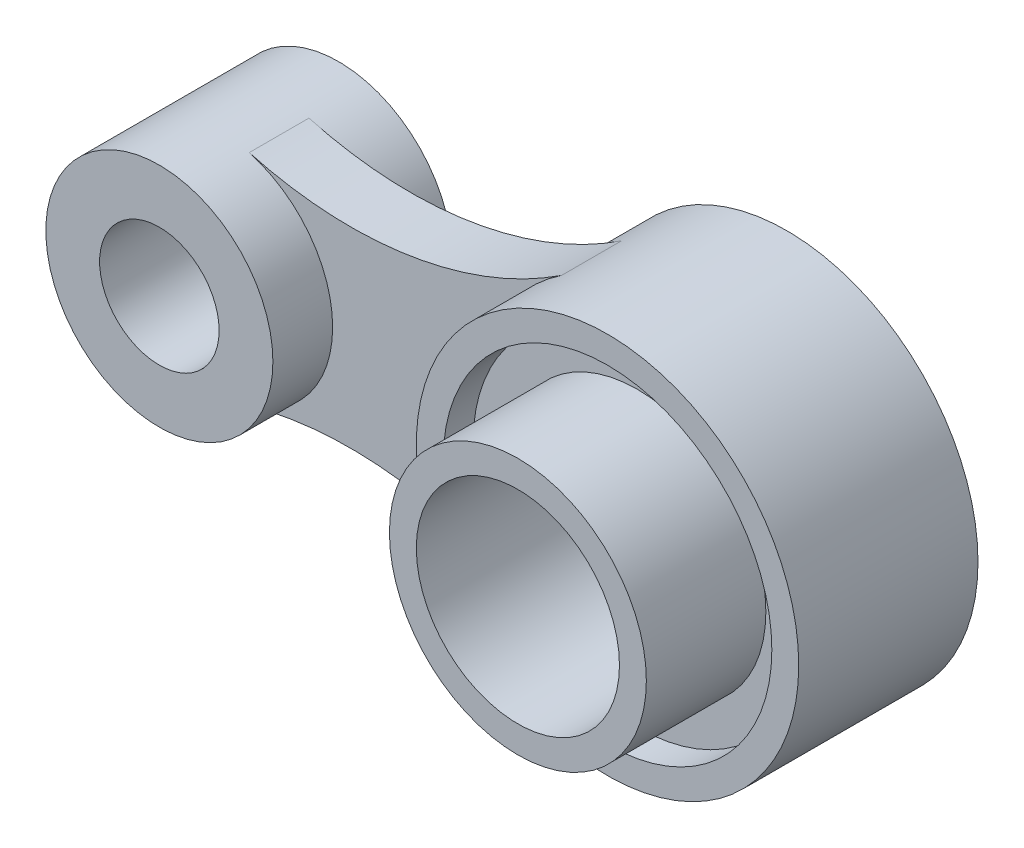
from build123d import *

# Parameters (mm, degrees)
BOSS_EXTRU_1_DEPTH      = 5
ESQUISSE5_3_R           = 32
ESQUISSE5_3_R_2         = 17
ESQUISSE5_3_R_3         = 19
ESQUISSE5_3_R_4         = 10
BOSS_EXTRU_2_DEPTH      = 15
BOSS_EXTRU_3_START      = 15
ESQUISSE5_4_R           = 21.5
ESQUISSE5_4_R_2         = 17
BOSS_EXTRU_3_DEPTH      = 15
ENL_V_START             = 10
ESQUISSE5_6_R           = 27.5
ESQUISSE5_6_R_2         = 21.5
ENL_V_MAT_EXTRU_1_DEPTH = 5


with BuildPart() as part:
    # Esquisse5 → Boss.-Extru.1 (new, symmetric)
    with BuildSketch(Plane.XY):
        with BuildLine():
            ThreePointArc((19.904299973, -26.678302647), (5.575411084, 0), (19.904299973, 26.678302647))
            ThreePointArc((19.904299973, 26.678302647), (-5.33863017, 16.836772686), (-32.391496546, 18.321243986))
            ThreePointArc((-32.391496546, 18.321243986), (-22.314513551, 11.518924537), (-18.424588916, 0))
            ThreePointArc((-18.424588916, 0), (-22.314513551, -11.518924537), (-32.391496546, -18.321243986))
            ThreePointArc((-32.391496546, -18.321243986), (-5.33863017, -16.836772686), (19.904299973, -26.678302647))
        make_face()
    extrude(amount=BOSS_EXTRU_1_DEPTH, both=True)

    # Esquisse5_3 → Boss.-Extru.2 (add, symmetric)
    # profile 1 of 2: a face of its own
    with BuildSketch(Plane.XY):
        with Locations((37.575411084, 0)):
            Circle(ESQUISSE5_3_R)
        with Locations((37.575411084, 0)):
            Circle(ESQUISSE5_3_R_2, mode=Mode.SUBTRACT)
    # profile 2 of 2: a face of its own
    with BuildSketch(Plane.XY):
        with Locations((-37.424588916, 0)):
            Circle(ESQUISSE5_3_R_3)
        with Locations((-37.424588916, 0)):
            Circle(ESQUISSE5_3_R_4, mode=Mode.SUBTRACT)
    extrude(amount=BOSS_EXTRU_2_DEPTH, both=True)

    # Esquisse5_4 → Boss.-Extru.3 (add)
    with BuildSketch(Plane.XY.offset(BOSS_EXTRU_3_START)):
        with Locations((37.575411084, 0)):
            Circle(ESQUISSE5_4_R)
        with Locations((37.575411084, 0)):
            Circle(ESQUISSE5_4_R_2, mode=Mode.SUBTRACT)
    extrude(amount=BOSS_EXTRU_3_DEPTH)

    # Esquisse5_6 → Enl_v. mat.-Extru.1 (cut)
    with BuildSketch(Plane.XY.offset(ENL_V_START)):
        with Locations((37.575411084, 0)):
            Circle(ESQUISSE5_6_R)
        with Locations((37.575411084, 0)):
            Circle(ESQUISSE5_6_R_2, mode=Mode.SUBTRACT)
    extrude(amount=ENL_V_MAT_EXTRU_1_DEPTH, mode=Mode.SUBTRACT)


solid = part.part
